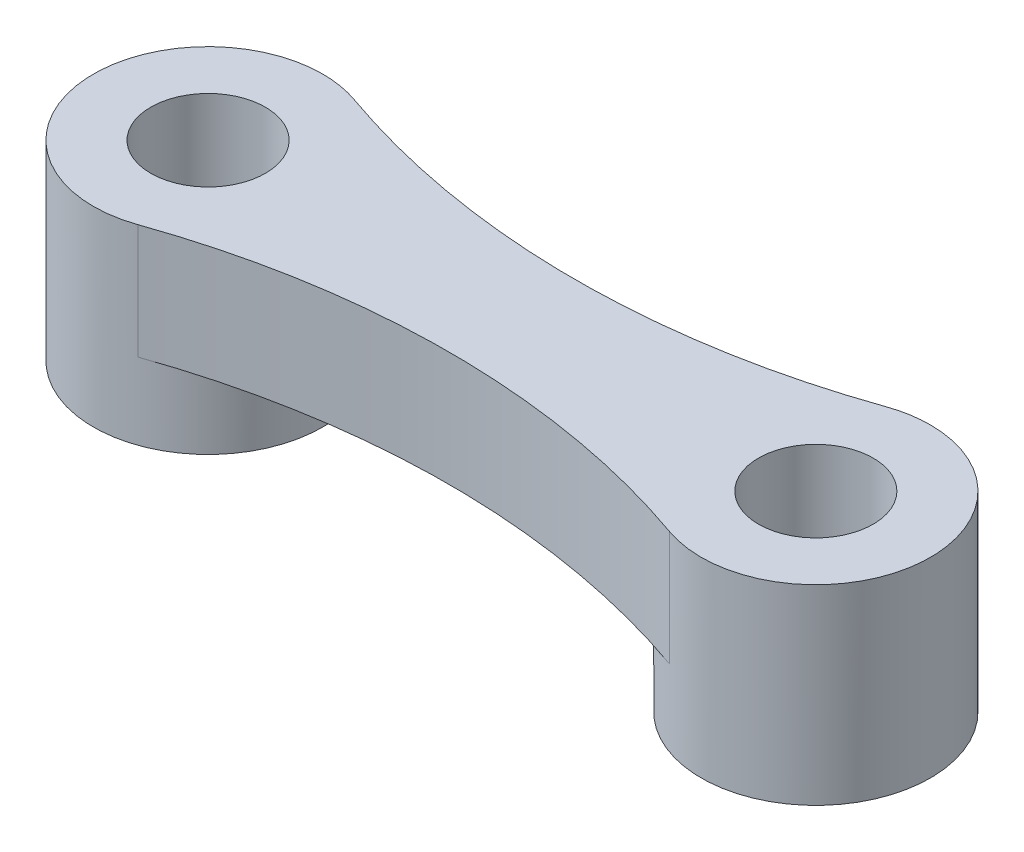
from build123d import *

# Parameters (mm, degrees)
EXTRUDE_1_DEPTH          = 3
EXTRUDE_START            = 2
SKETCH_2_R               = 3
EXTRUDE_2_DEPTH          = 2
SKETCH_3_R               = 3
EXTRUDE_3_DEPTH          = 2
F_3_0_3_DIAMETER_HOLE1_D = 3


with BuildPart() as part:
    # Sketch 1 → Extrude 1 (new body)
    with BuildSketch(Plane.XZ):
        with BuildLine():
            ThreePointArc((-6.95625, -2.830629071), (0, -1.645032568), (6.95625, -2.830629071))
            ThreePointArc((6.95625, -2.830629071), (10.95, 0), (6.95625, 2.830629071))
            ThreePointArc((6.95625, 2.830629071), (0, 1.645032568), (-6.95625, 2.830629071))
            ThreePointArc((-6.95625, 2.830629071), (-10.95, 0), (-6.95625, -2.830629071))
        make_face()
    extrude(amount=-EXTRUDE_1_DEPTH)

    # Sketch 2 → Extrude 2 (add)
    with BuildSketch(Plane.XZ.offset(EXTRUDE_START)):
        with Locations(Location((7.95, 0, 0), (0, 0, 269.999999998))):
            Circle(SKETCH_2_R)
    extrude(amount=-EXTRUDE_2_DEPTH)

    # Sketch 3 → Extrude 3 (add)
    with BuildSketch(Plane.XZ.offset(EXTRUDE_START)):
        with Locations(Location((-7.95, 0, 0), (0, 0, 270))):
            Circle(SKETCH_3_R)
    extrude(amount=-EXTRUDE_3_DEPTH)

    # 3.0 _3_ Diameter Hole1 (through all)
    with Locations(Plane(origin=(0, 3, 0), x_dir=(1, 0, 0), z_dir=(0, 1, 0))):
        with Locations((-7.95, 0), (7.95, 0)):
            Hole(F_3_0_3_DIAMETER_HOLE1_D / 2)


solid = part.part
